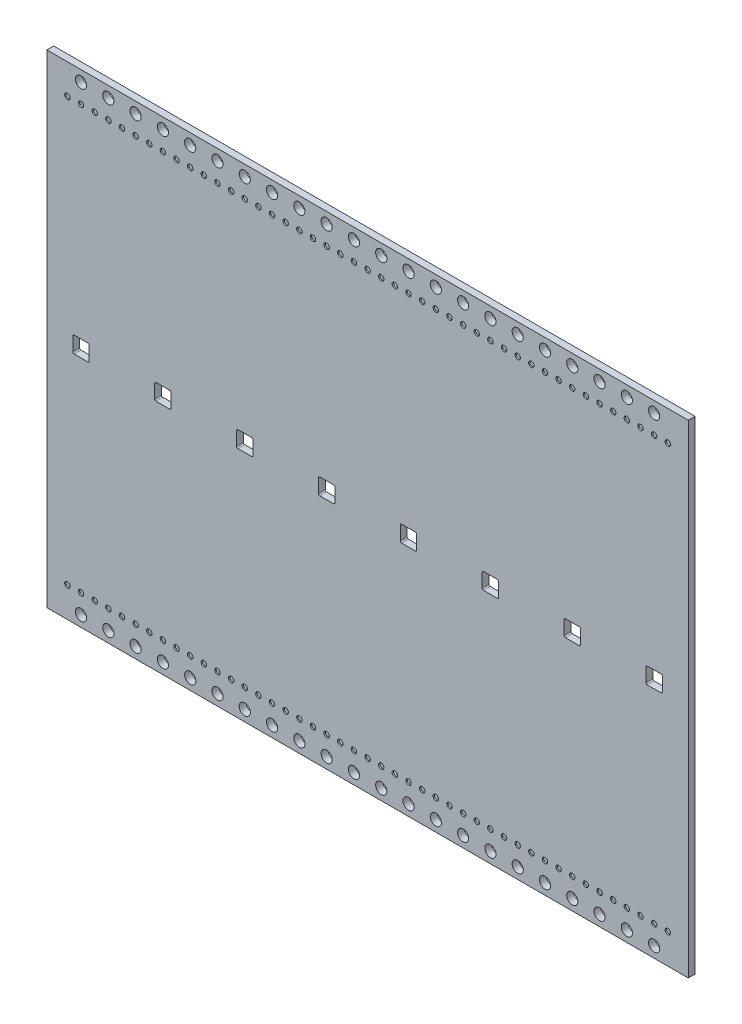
from build123d import *

# Parameters (mm, degrees)
SKETCH_1_W          = 235
SKETCH_1_H          = 177
SKETCH_1_R          = 2.05
EXTRUDE_1_DEPTH     = 1.25
SKETCH_2_R          = 1
CUT_EXTRUDE_1_DEPTH = 0.5
SKETCH_3_R          = 1
EXTRUDE_2_DEPTH     = 1
CUT_EXTRUDE_2_DEPTH = 10


with BuildPart() as part:
    # Sketch 1 → Extrude 1 (new, symmetric)
    with BuildSketch(Plane.XY):
        Rectangle(SKETCH_1_W, SKETCH_1_H)
        with Locations((-105, 84.5)):
            Circle(SKETCH_1_R, mode=Mode.SUBTRACT)
        with Locations((-95, 84.5)):
            Circle(SKETCH_1_R, mode=Mode.SUBTRACT)
        with Locations((-95, -84.5)):
            Circle(SKETCH_1_R, mode=Mode.SUBTRACT)
        with Locations((-85, 84.5)):
            Circle(SKETCH_1_R, mode=Mode.SUBTRACT)
        with Locations((-85, -84.5)):
            Circle(SKETCH_1_R, mode=Mode.SUBTRACT)
        with Locations((-75, 84.5)):
            Circle(SKETCH_1_R, mode=Mode.SUBTRACT)
        with Locations((-75, -84.5)):
            Circle(SKETCH_1_R, mode=Mode.SUBTRACT)
        with Locations((-65, 84.5)):
            Circle(SKETCH_1_R, mode=Mode.SUBTRACT)
        with Locations((-65, -84.5)):
            Circle(SKETCH_1_R, mode=Mode.SUBTRACT)
        with Locations((-55, 84.5)):
            Circle(SKETCH_1_R, mode=Mode.SUBTRACT)
        with Locations((-55, -84.5)):
            Circle(SKETCH_1_R, mode=Mode.SUBTRACT)
        with Locations((-45, 84.5)):
            Circle(SKETCH_1_R, mode=Mode.SUBTRACT)
        with Locations((-45, -84.5)):
            Circle(SKETCH_1_R, mode=Mode.SUBTRACT)
        with Locations((-35, 84.5)):
            Circle(SKETCH_1_R, mode=Mode.SUBTRACT)
        with Locations((-35, -84.5)):
            Circle(SKETCH_1_R, mode=Mode.SUBTRACT)
        with Locations((-25, 84.5)):
            Circle(SKETCH_1_R, mode=Mode.SUBTRACT)
        with Locations((-25, -84.5)):
            Circle(SKETCH_1_R, mode=Mode.SUBTRACT)
        with Locations((-15, 84.5)):
            Circle(SKETCH_1_R, mode=Mode.SUBTRACT)
        with Locations((-15, -84.5)):
            Circle(SKETCH_1_R, mode=Mode.SUBTRACT)
        with Locations((-5, 84.5)):
            Circle(SKETCH_1_R, mode=Mode.SUBTRACT)
        with Locations((-5, -84.5)):
            Circle(SKETCH_1_R, mode=Mode.SUBTRACT)
        with Locations((5, 84.5)):
            Circle(SKETCH_1_R, mode=Mode.SUBTRACT)
        with Locations((5, -84.5)):
            Circle(SKETCH_1_R, mode=Mode.SUBTRACT)
        with Locations((15, 84.5)):
            Circle(SKETCH_1_R, mode=Mode.SUBTRACT)
        with Locations((15, -84.5)):
            Circle(SKETCH_1_R, mode=Mode.SUBTRACT)
        with Locations((25, 84.5)):
            Circle(SKETCH_1_R, mode=Mode.SUBTRACT)
        with Locations((25, -84.5)):
            Circle(SKETCH_1_R, mode=Mode.SUBTRACT)
        with Locations((35, 84.5)):
            Circle(SKETCH_1_R, mode=Mode.SUBTRACT)
        with Locations((35, -84.5)):
            Circle(SKETCH_1_R, mode=Mode.SUBTRACT)
        with Locations((45, 84.5)):
            Circle(SKETCH_1_R, mode=Mode.SUBTRACT)
        with Locations((45, -84.5)):
            Circle(SKETCH_1_R, mode=Mode.SUBTRACT)
        with Locations((55, 84.5)):
            Circle(SKETCH_1_R, mode=Mode.SUBTRACT)
        with Locations((55, -84.5)):
            Circle(SKETCH_1_R, mode=Mode.SUBTRACT)
        with Locations((65, 84.5)):
            Circle(SKETCH_1_R, mode=Mode.SUBTRACT)
        with Locations((65, -84.5)):
            Circle(SKETCH_1_R, mode=Mode.SUBTRACT)
        with Locations((75, 84.5)):
            Circle(SKETCH_1_R, mode=Mode.SUBTRACT)
        with Locations((75, -84.5)):
            Circle(SKETCH_1_R, mode=Mode.SUBTRACT)
        with Locations((85, 84.5)):
            Circle(SKETCH_1_R, mode=Mode.SUBTRACT)
        with Locations((85, -84.5)):
            Circle(SKETCH_1_R, mode=Mode.SUBTRACT)
        with Locations((95, 84.5)):
            Circle(SKETCH_1_R, mode=Mode.SUBTRACT)
        with Locations((95, -84.5)):
            Circle(SKETCH_1_R, mode=Mode.SUBTRACT)
        with Locations((105, 84.5)):
            Circle(SKETCH_1_R, mode=Mode.SUBTRACT)
        with Locations((105, -84.5)):
            Circle(SKETCH_1_R, mode=Mode.SUBTRACT)
        with Locations((-105, -84.5)):
            Circle(SKETCH_1_R, mode=Mode.SUBTRACT)
    extrude(amount=EXTRUDE_1_DEPTH, both=True)

    # Sketch 2 → Cut-Extrude 1 (cut)
    with BuildSketch(Plane.XY.offset(1.25)):
        with Locations((-110, 77.5)):
            Circle(SKETCH_2_R)
        with Locations((-110, -77.5)):
            Circle(SKETCH_2_R)
        with Locations((-105, 77.5)):
            Circle(SKETCH_2_R)
        with Locations((-105, -77.5)):
            Circle(SKETCH_2_R)
        with Locations((-100, 77.5)):
            Circle(SKETCH_2_R)
        with Locations((-100, -77.5)):
            Circle(SKETCH_2_R)
        with Locations((-95, 77.5)):
            Circle(SKETCH_2_R)
        with Locations((-95, -77.5)):
            Circle(SKETCH_2_R)
        with Locations((-90, 77.5)):
            Circle(SKETCH_2_R)
        with Locations((-90, -77.5)):
            Circle(SKETCH_2_R)
        with Locations((-85, 77.5)):
            Circle(SKETCH_2_R)
        with Locations((-85, -77.5)):
            Circle(SKETCH_2_R)
        with Locations((-80, 77.5)):
            Circle(SKETCH_2_R)
        with Locations((-80, -77.5)):
            Circle(SKETCH_2_R)
        with Locations((-75, 77.5)):
            Circle(SKETCH_2_R)
        with Locations((-75, -77.5)):
            Circle(SKETCH_2_R)
        with Locations((-70, 77.5)):
            Circle(SKETCH_2_R)
        with Locations((-70, -77.5)):
            Circle(SKETCH_2_R)
        with Locations((-65, 77.5)):
            Circle(SKETCH_2_R)
        with Locations((-65, -77.5)):
            Circle(SKETCH_2_R)
        with Locations((-60, 77.5)):
            Circle(SKETCH_2_R)
        with Locations((-60, -77.5)):
            Circle(SKETCH_2_R)
        with Locations((-55, 77.5)):
            Circle(SKETCH_2_R)
        with Locations((-55, -77.5)):
            Circle(SKETCH_2_R)
        with Locations((-50, 77.5)):
            Circle(SKETCH_2_R)
        with Locations((-50, -77.5)):
            Circle(SKETCH_2_R)
        with Locations((-45, 77.5)):
            Circle(SKETCH_2_R)
        with Locations((-45, -77.5)):
            Circle(SKETCH_2_R)
        with Locations((-40, 77.5)):
            Circle(SKETCH_2_R)
        with Locations((-40, -77.5)):
            Circle(SKETCH_2_R)
        with Locations((-35, 77.5)):
            Circle(SKETCH_2_R)
        with Locations((-35, -77.5)):
            Circle(SKETCH_2_R)
        with Locations((-30, 77.5)):
            Circle(SKETCH_2_R)
        with Locations((-30, -77.5)):
            Circle(SKETCH_2_R)
        with Locations((-25, 77.5)):
            Circle(SKETCH_2_R)
        with Locations((-25, -77.5)):
            Circle(SKETCH_2_R)
        with Locations((-20, 77.5)):
            Circle(SKETCH_2_R)
        with Locations((-20, -77.5)):
            Circle(SKETCH_2_R)
        with Locations((-15, 77.5)):
            Circle(SKETCH_2_R)
        with Locations((-15, -77.5)):
            Circle(SKETCH_2_R)
        with Locations((-10, 77.5)):
            Circle(SKETCH_2_R)
        with Locations((-10, -77.5)):
            Circle(SKETCH_2_R)
        with Locations((-5, 77.5)):
            Circle(SKETCH_2_R)
        with Locations((-5, -77.5)):
            Circle(SKETCH_2_R)
        with Locations((0, 77.5)):
            Circle(SKETCH_2_R)
        with Locations((0, -77.5)):
            Circle(SKETCH_2_R)
        with Locations((5, 77.5)):
            Circle(SKETCH_2_R)
        with Locations((5, -77.5)):
            Circle(SKETCH_2_R)
        with Locations((10, 77.5)):
            Circle(SKETCH_2_R)
        with Locations((10, -77.5)):
            Circle(SKETCH_2_R)
        with Locations((15, 77.5)):
            Circle(SKETCH_2_R)
        with Locations((15, -77.5)):
            Circle(SKETCH_2_R)
        with Locations((20, 77.5)):
            Circle(SKETCH_2_R)
        with Locations((20, -77.5)):
            Circle(SKETCH_2_R)
        with Locations((25, 77.5)):
            Circle(SKETCH_2_R)
        with Locations((25, -77.5)):
            Circle(SKETCH_2_R)
        with Locations((30, 77.5)):
            Circle(SKETCH_2_R)
        with Locations((30, -77.5)):
            Circle(SKETCH_2_R)
        with Locations((35, 77.5)):
            Circle(SKETCH_2_R)
        with Locations((35, -77.5)):
            Circle(SKETCH_2_R)
        with Locations((40, 77.5)):
            Circle(SKETCH_2_R)
        with Locations((40, -77.5)):
            Circle(SKETCH_2_R)
        with Locations((45, 77.5)):
            Circle(SKETCH_2_R)
        with Locations((45, -77.5)):
            Circle(SKETCH_2_R)
        with Locations((50, 77.5)):
            Circle(SKETCH_2_R)
        with Locations((50, -77.5)):
            Circle(SKETCH_2_R)
        with Locations((55, 77.5)):
            Circle(SKETCH_2_R)
        with Locations((55, -77.5)):
            Circle(SKETCH_2_R)
        with Locations((60, 77.5)):
            Circle(SKETCH_2_R)
        with Locations((60, -77.5)):
            Circle(SKETCH_2_R)
        with Locations((65, 77.5)):
            Circle(SKETCH_2_R)
        with Locations((65, -77.5)):
            Circle(SKETCH_2_R)
        with Locations((70, 77.5)):
            Circle(SKETCH_2_R)
        with Locations((70, -77.5)):
            Circle(SKETCH_2_R)
        with Locations((75, 77.5)):
            Circle(SKETCH_2_R)
        with Locations((75, -77.5)):
            Circle(SKETCH_2_R)
        with Locations((80, 77.5)):
            Circle(SKETCH_2_R)
        with Locations((80, -77.5)):
            Circle(SKETCH_2_R)
        with Locations((85, 77.5)):
            Circle(SKETCH_2_R)
        with Locations((85, -77.5)):
            Circle(SKETCH_2_R)
        with Locations((90, 77.5)):
            Circle(SKETCH_2_R)
        with Locations((90, -77.5)):
            Circle(SKETCH_2_R)
        with Locations((95, 77.5)):
            Circle(SKETCH_2_R)
        with Locations((95, -77.5)):
            Circle(SKETCH_2_R)
        with Locations((100, 77.5)):
            Circle(SKETCH_2_R)
        with Locations((100, -77.5)):
            Circle(SKETCH_2_R)
        with Locations((105, 77.5)):
            Circle(SKETCH_2_R)
        with Locations((105, -77.5)):
            Circle(SKETCH_2_R)
        with Locations((110, 77.5)):
            Circle(SKETCH_2_R)
        with Locations((110, -77.5)):
            Circle(SKETCH_2_R)
    extrude(amount=-CUT_EXTRUDE_1_DEPTH, mode=Mode.SUBTRACT)

    # Sketch 3 → Extrude 2 (add)
    with BuildSketch(Plane(origin=(0, 0, -1.25), x_dir=(-1, 0, 0), z_dir=(0, 0, -1))):
        with Locations(Location((110, 77.5, 0), (0, 0, 180))):
            Circle(SKETCH_3_R)
        with Locations(Location((110, -77.5, 0), (0, 0, 180))):
            Circle(SKETCH_3_R)
        with Locations(Location((105, 77.5, 0), (0, 0, 180))):
            Circle(SKETCH_3_R)
        with Locations(Location((105, -77.5, 0), (0, 0, 180))):
            Circle(SKETCH_3_R)
        with Locations(Location((100, 77.5, 0), (0, 0, 180))):
            Circle(SKETCH_3_R)
        with Locations(Location((100, -77.5, 0), (0, 0, 180))):
            Circle(SKETCH_3_R)
        with Locations(Location((95, 77.5, 0), (0, 0, 180))):
            Circle(SKETCH_3_R)
        with Locations(Location((95, -77.5, 0), (0, 0, 180))):
            Circle(SKETCH_3_R)
        with Locations(Location((90, 77.5, 0), (0, 0, 180))):
            Circle(SKETCH_3_R)
        with Locations(Location((90, -77.5, 0), (0, 0, 180))):
            Circle(SKETCH_3_R)
        with Locations(Location((85, 77.5, 0), (0, 0, 180))):
            Circle(SKETCH_3_R)
        with Locations(Location((85, -77.5, 0), (0, 0, 180))):
            Circle(SKETCH_3_R)
        with Locations(Location((80, 77.5, 0), (0, 0, 180))):
            Circle(SKETCH_3_R)
        with Locations(Location((80, -77.5, 0), (0, 0, 180))):
            Circle(SKETCH_3_R)
        with Locations(Location((75, 77.5, 0), (0, 0, 180))):
            Circle(SKETCH_3_R)
        with Locations(Location((75, -77.5, 0), (0, 0, 180))):
            Circle(SKETCH_3_R)
        with Locations(Location((70, 77.5, 0), (0, 0, 180))):
            Circle(SKETCH_3_R)
        with Locations(Location((70, -77.5, 0), (0, 0, 180))):
            Circle(SKETCH_3_R)
        with Locations(Location((65, 77.5, 0), (0, 0, 180))):
            Circle(SKETCH_3_R)
        with Locations(Location((65, -77.5, 0), (0, 0, 180))):
            Circle(SKETCH_3_R)
        with Locations(Location((60, 77.5, 0), (0, 0, 180))):
            Circle(SKETCH_3_R)
        with Locations(Location((60, -77.5, 0), (0, 0, 180))):
            Circle(SKETCH_3_R)
        with Locations(Location((55, 77.5, 0), (0, 0, 180))):
            Circle(SKETCH_3_R)
        with Locations(Location((55, -77.5, 0), (0, 0, 180))):
            Circle(SKETCH_3_R)
        with Locations(Location((50, 77.5, 0), (0, 0, 180))):
            Circle(SKETCH_3_R)
        with Locations(Location((50, -77.5, 0), (0, 0, 180))):
            Circle(SKETCH_3_R)
        with Locations(Location((45, 77.5, 0), (0, 0, 180))):
            Circle(SKETCH_3_R)
        with Locations(Location((45, -77.5, 0), (0, 0, 180))):
            Circle(SKETCH_3_R)
        with Locations(Location((40, 77.5, 0), (0, 0, 180))):
            Circle(SKETCH_3_R)
        with Locations(Location((40, -77.5, 0), (0, 0, 180))):
            Circle(SKETCH_3_R)
        with Locations(Location((35, 77.5, 0), (0, 0, 180))):
            Circle(SKETCH_3_R)
        with Locations(Location((35, -77.5, 0), (0, 0, 180))):
            Circle(SKETCH_3_R)
        with Locations(Location((30, 77.5, 0), (0, 0, 180))):
            Circle(SKETCH_3_R)
        with Locations(Location((30, -77.5, 0), (0, 0, 180))):
            Circle(SKETCH_3_R)
        with Locations(Location((25, 77.5, 0), (0, 0, 180))):
            Circle(SKETCH_3_R)
        with Locations(Location((25, -77.5, 0), (0, 0, 180))):
            Circle(SKETCH_3_R)
        with Locations(Location((20, 77.5, 0), (0, 0, 180))):
            Circle(SKETCH_3_R)
        with Locations(Location((20, -77.5, 0), (0, 0, 180))):
            Circle(SKETCH_3_R)
        with Locations(Location((15, 77.5, 0), (0, 0, 180))):
            Circle(SKETCH_3_R)
        with Locations(Location((15, -77.5, 0), (0, 0, 180))):
            Circle(SKETCH_3_R)
        with Locations(Location((10, 77.5, 0), (0, 0, 180))):
            Circle(SKETCH_3_R)
        with Locations(Location((10, -77.5, 0), (0, 0, 180))):
            Circle(SKETCH_3_R)
        with Locations(Location((5, 77.5, 0), (0, 0, 180))):
            Circle(SKETCH_3_R)
        with Locations(Location((5, -77.5, 0), (0, 0, 180))):
            Circle(SKETCH_3_R)
        with Locations(Location((0, 77.5, 0), (0, 0, 180))):
            Circle(SKETCH_3_R)
        with Locations(Location((0, -77.5, 0), (0, 0, 180))):
            Circle(SKETCH_3_R)
        with Locations(Location((-5, 77.5, 0), (0, 0, 180))):
            Circle(SKETCH_3_R)
        with Locations(Location((-5, -77.5, 0), (0, 0, 180))):
            Circle(SKETCH_3_R)
        with Locations(Location((-10, 77.5, 0), (0, 0, 180))):
            Circle(SKETCH_3_R)
        with Locations(Location((-10, -77.5, 0), (0, 0, 180))):
            Circle(SKETCH_3_R)
        with Locations(Location((-15, 77.5, 0), (0, 0, 180))):
            Circle(SKETCH_3_R)
        with Locations(Location((-15, -77.5, 0), (0, 0, 180))):
            Circle(SKETCH_3_R)
        with Locations(Location((-20, 77.5, 0), (0, 0, 180))):
            Circle(SKETCH_3_R)
        with Locations(Location((-20, -77.5, 0), (0, 0, 180))):
            Circle(SKETCH_3_R)
        with Locations(Location((-25, 77.5, 0), (0, 0, 180))):
            Circle(SKETCH_3_R)
        with Locations(Location((-25, -77.5, 0), (0, 0, 180))):
            Circle(SKETCH_3_R)
        with Locations(Location((-30, 77.5, 0), (0, 0, 180))):
            Circle(SKETCH_3_R)
        with Locations(Location((-30, -77.5, 0), (0, 0, 180))):
            Circle(SKETCH_3_R)
        with Locations(Location((-35, 77.5, 0), (0, 0, 180))):
            Circle(SKETCH_3_R)
        with Locations(Location((-35, -77.5, 0), (0, 0, 180))):
            Circle(SKETCH_3_R)
        with Locations(Location((-40, 77.5, 0), (0, 0, 180))):
            Circle(SKETCH_3_R)
        with Locations(Location((-40, -77.5, 0), (0, 0, 180))):
            Circle(SKETCH_3_R)
        with Locations(Location((-45, 77.5, 0), (0, 0, 180))):
            Circle(SKETCH_3_R)
        with Locations(Location((-45, -77.5, 0), (0, 0, 180))):
            Circle(SKETCH_3_R)
        with Locations(Location((-50, 77.5, 0), (0, 0, 180))):
            Circle(SKETCH_3_R)
        with Locations(Location((-50, -77.5, 0), (0, 0, 180))):
            Circle(SKETCH_3_R)
        with Locations(Location((-55, 77.5, 0), (0, 0, 180))):
            Circle(SKETCH_3_R)
        with Locations(Location((-55, -77.5, 0), (0, 0, 180))):
            Circle(SKETCH_3_R)
        with Locations(Location((-60, 77.5, 0), (0, 0, 180))):
            Circle(SKETCH_3_R)
        with Locations(Location((-60, -77.5, 0), (0, 0, 180))):
            Circle(SKETCH_3_R)
        with Locations(Location((-65, 77.5, 0), (0, 0, 180))):
            Circle(SKETCH_3_R)
        with Locations(Location((-65, -77.5, 0), (0, 0, 180))):
            Circle(SKETCH_3_R)
        with Locations(Location((-70, 77.5, 0), (0, 0, 180))):
            Circle(SKETCH_3_R)
        with Locations(Location((-70, -77.5, 0), (0, 0, 180))):
            Circle(SKETCH_3_R)
        with Locations(Location((-75, 77.5, 0), (0, 0, 180))):
            Circle(SKETCH_3_R)
        with Locations(Location((-75, -77.5, 0), (0, 0, 180))):
            Circle(SKETCH_3_R)
        with Locations(Location((-80, 77.5, 0), (0, 0, 180))):
            Circle(SKETCH_3_R)
        with Locations(Location((-80, -77.5, 0), (0, 0, 180))):
            Circle(SKETCH_3_R)
        with Locations(Location((-85, 77.5, 0), (0, 0, 180))):
            Circle(SKETCH_3_R)
        with Locations(Location((-85, -77.5, 0), (0, 0, 180))):
            Circle(SKETCH_3_R)
        with Locations(Location((-90, 77.5, 0), (0, 0, 180))):
            Circle(SKETCH_3_R)
        with Locations(Location((-90, -77.5, 0), (0, 0, 180))):
            Circle(SKETCH_3_R)
        with Locations(Location((-95, 77.5, 0), (0, 0, 180))):
            Circle(SKETCH_3_R)
        with Locations(Location((-95, -77.5, 0), (0, 0, 180))):
            Circle(SKETCH_3_R)
        with Locations(Location((-100, 77.5, 0), (0, 0, 180))):
            Circle(SKETCH_3_R)
        with Locations(Location((-100, -77.5, 0), (0, 0, 180))):
            Circle(SKETCH_3_R)
        with Locations(Location((-105, 77.5, 0), (0, 0, 180))):
            Circle(SKETCH_3_R)
        with Locations(Location((-105, -77.5, 0), (0, 0, 180))):
            Circle(SKETCH_3_R)
        with Locations(Location((-110, 77.5, 0), (0, 0, 180))):
            Circle(SKETCH_3_R)
        with Locations(Location((-110, -77.5, 0), (0, 0, 180))):
            Circle(SKETCH_3_R)
    extrude(amount=EXTRUDE_2_DEPTH)

    # Sketch 4 → Cut-Extrude 2 (cut)
    with BuildSketch(Plane.XY.offset(1.25)):
        with BuildLine():
            Line((-107.5, -3), (-102.5, -3))
            ThreePointArc((-102.5, -3), (-102.146446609, -2.853553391), (-102, -2.5))
            Line((-102, -2.5), (-102, 2.5))
            ThreePointArc((-102, 2.5), (-102.146446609, 2.853553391), (-102.5, 3))
            Line((-102.5, 3), (-107.5, 3))
            ThreePointArc((-107.5, 3), (-107.853553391, 2.853553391), (-108, 2.5))
            Line((-108, 2.5), (-108, -2.5))
            ThreePointArc((-108, -2.5), (-107.853553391, -2.853553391), (-107.5, -3))
        make_face()
        with BuildLine():
            Line((-77.5, 3), (-72.5, 3))
            ThreePointArc((-72.5, 3), (-72.146446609, 2.853553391), (-72, 2.5))
            Line((-72, 2.5), (-72, -2.5))
            ThreePointArc((-72, -2.5), (-72.146446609, -2.853553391), (-72.5, -3))
            Line((-72.5, -3), (-77.5, -3))
            ThreePointArc((-77.5, -3), (-77.853553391, -2.853553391), (-78, -2.5))
            Line((-78, -2.5), (-78, 2.5))
            ThreePointArc((-78, 2.5), (-77.853553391, 2.853553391), (-77.5, 3))
        make_face()
        with BuildLine():
            Line((-47.5, 3), (-42.5, 3))
            ThreePointArc((-42.5, 3), (-42.146446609, 2.853553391), (-42, 2.5))
            Line((-42, 2.5), (-42, -2.5))
            ThreePointArc((-42, -2.5), (-42.146446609, -2.853553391), (-42.5, -3))
            Line((-42.5, -3), (-47.5, -3))
            ThreePointArc((-47.5, -3), (-47.853553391, -2.853553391), (-48, -2.5))
            Line((-48, -2.5), (-48, 2.5))
            ThreePointArc((-48, 2.5), (-47.853553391, 2.853553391), (-47.5, 3))
        make_face()
        with BuildLine():
            Line((-17.5, 3), (-12.5, 3))
            ThreePointArc((-12.5, 3), (-12.146446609, 2.853553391), (-12, 2.5))
            Line((-12, 2.5), (-12, -2.5))
            ThreePointArc((-12, -2.5), (-12.146446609, -2.853553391), (-12.5, -3))
            Line((-12.5, -3), (-17.5, -3))
            ThreePointArc((-17.5, -3), (-17.853553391, -2.853553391), (-18, -2.5))
            Line((-18, -2.5), (-18, 2.5))
            ThreePointArc((-18, 2.5), (-17.853553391, 2.853553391), (-17.5, 3))
        make_face()
        with BuildLine():
            Line((12.5, 3), (17.5, 3))
            ThreePointArc((17.5, 3), (17.853553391, 2.853553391), (18, 2.5))
            Line((18, 2.5), (18, -2.5))
            ThreePointArc((18, -2.5), (17.853553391, -2.853553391), (17.5, -3))
            Line((17.5, -3), (12.5, -3))
            ThreePointArc((12.5, -3), (12.146446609, -2.853553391), (12, -2.5))
            Line((12, -2.5), (12, 2.5))
            ThreePointArc((12, 2.5), (12.146446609, 2.853553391), (12.5, 3))
        make_face()
        with BuildLine():
            Line((42.5, 3), (47.5, 3))
            ThreePointArc((47.5, 3), (47.853553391, 2.853553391), (48, 2.5))
            Line((48, 2.5), (48, -2.5))
            ThreePointArc((48, -2.5), (47.853553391, -2.853553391), (47.5, -3))
            Line((47.5, -3), (42.5, -3))
            ThreePointArc((42.5, -3), (42.146446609, -2.853553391), (42, -2.5))
            Line((42, -2.5), (42, 2.5))
            ThreePointArc((42, 2.5), (42.146446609, 2.853553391), (42.5, 3))
        make_face()
        with BuildLine():
            Line((72.5, 3), (77.5, 3))
            ThreePointArc((77.5, 3), (77.853553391, 2.853553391), (78, 2.5))
            Line((78, 2.5), (78, -2.5))
            ThreePointArc((78, -2.5), (77.853553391, -2.853553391), (77.5, -3))
            Line((77.5, -3), (72.5, -3))
            ThreePointArc((72.5, -3), (72.146446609, -2.853553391), (72, -2.5))
            Line((72, -2.5), (72, 2.5))
            ThreePointArc((72, 2.5), (72.146446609, 2.853553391), (72.5, 3))
        make_face()
        with BuildLine():
            Line((102.5, 3), (107.5, 3))
            ThreePointArc((107.5, 3), (107.853553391, 2.853553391), (108, 2.5))
            Line((108, 2.5), (108, -2.5))
            ThreePointArc((108, -2.5), (107.853553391, -2.853553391), (107.5, -3))
            Line((107.5, -3), (102.5, -3))
            ThreePointArc((102.5, -3), (102.146446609, -2.853553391), (102, -2.5))
            Line((102, -2.5), (102, 2.5))
            ThreePointArc((102, 2.5), (102.146446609, 2.853553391), (102.5, 3))
        make_face()
    extrude(amount=-CUT_EXTRUDE_2_DEPTH, mode=Mode.SUBTRACT)


solid = part.part
